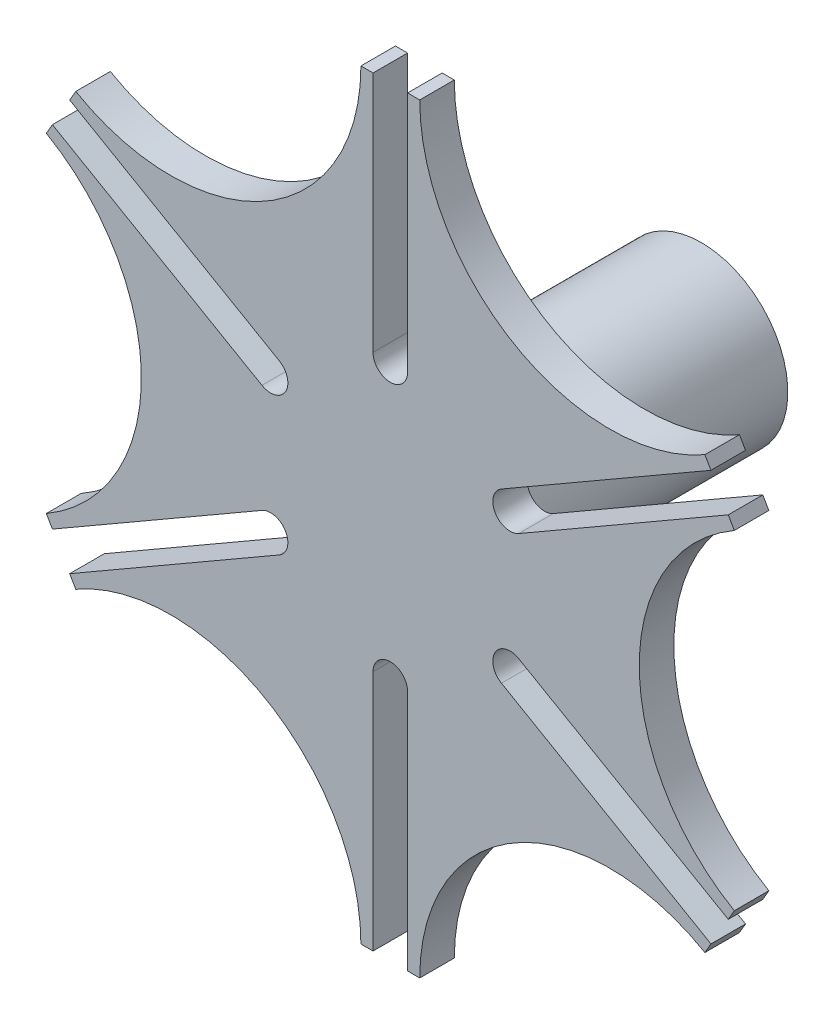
ISO-10303-21;
HEADER;
FILE_DESCRIPTION(('STEP AP214'),'2;1');
FILE_NAME('part.step','',(''),(''),'','','');
FILE_SCHEMA(('AUTOMOTIVE_DESIGN { 1 0 10303 214 1 1 1 1 }'));
ENDSEC;
DATA;
#1=APPLICATION_CONTEXT('core data for automotive mechanical design processes');
#2=APPLICATION_PROTOCOL_DEFINITION('international standard','automotive_design',2000,#1);
#3=PRODUCT_CONTEXT('',#1,'mechanical');
#4=PRODUCT('Part','Part','',(#3));
#5=PRODUCT_RELATED_PRODUCT_CATEGORY('part','',(#4));
#6=PRODUCT_DEFINITION_FORMATION('','',#4);
#7=PRODUCT_DEFINITION_CONTEXT('part definition',#1,'design');
#8=PRODUCT_DEFINITION('design','',#6,#7);
#9=PRODUCT_DEFINITION_SHAPE('','',#8);
#10=(LENGTH_UNIT() NAMED_UNIT(*) SI_UNIT(.MILLI.,.METRE.));
#11=(NAMED_UNIT(*) PLANE_ANGLE_UNIT() SI_UNIT($,.RADIAN.));
#12=(NAMED_UNIT(*) SI_UNIT($,.STERADIAN.) SOLID_ANGLE_UNIT());
#13=UNCERTAINTY_MEASURE_WITH_UNIT(LENGTH_MEASURE(1.E-05),#10,'distance_accuracy_value','');
#14=(GEOMETRIC_REPRESENTATION_CONTEXT(3) GLOBAL_UNCERTAINTY_ASSIGNED_CONTEXT((#13)) GLOBAL_UNIT_ASSIGNED_CONTEXT((#10,
#11,#12)) REPRESENTATION_CONTEXT('',''));
#15=CARTESIAN_POINT('',(0.,0.,0.));
#16=DIRECTION('',(0.,0.,1.));
#17=DIRECTION('',(1.,0.,0.));
#18=AXIS2_PLACEMENT_3D('',#15,#16,#17);
#19=CARTESIAN_POINT('',(161.311665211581,0.,12.7));
#20=DIRECTION('',(-0.866025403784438,-0.500000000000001,0.));
#21=DIRECTION('',(0.500000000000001,-0.866025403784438,0.));
#22=AXIS2_PLACEMENT_3D('',#19,#20,#21);
#23=PLANE('',#22);
#24=DIRECTION('',(-0.500000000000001,0.866025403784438,0.));
#25=VECTOR('',#24,1.);
#26=CARTESIAN_POINT('',(161.311665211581,0.,0.));
#27=LINE('',#26,#25);
#28=CARTESIAN_POINT('',(126.386665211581,60.4918744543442,0.));
#29=VERTEX_POINT('',#28);
#30=CARTESIAN_POINT('',(124.158748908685,64.3507386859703,0.));
#31=VERTEX_POINT('',#30);
#32=EDGE_CURVE('E476',#29,#31,#27,.T.);
#33=ORIENTED_EDGE('',*,*,#32,.T.);
#34=DIRECTION('',(0.,0.,1.));
#35=VECTOR('',#34,1.);
#36=CARTESIAN_POINT('',(124.158748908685,64.3507386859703,-101.6));
#37=LINE('',#36,#35);
#38=CARTESIAN_POINT('',(124.158748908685,64.3507386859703,12.7));
#39=VERTEX_POINT('',#38);
#40=EDGE_CURVE('E285',#31,#39,#37,.T.);
#41=ORIENTED_EDGE('',*,*,#40,.T.);
#42=DIRECTION('',(-0.500000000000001,0.866025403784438,0.));
#43=VECTOR('',#42,1.);
#44=CARTESIAN_POINT('',(161.311665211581,0.,12.7));
#45=LINE('',#44,#43);
#46=CARTESIAN_POINT('',(126.386665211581,60.4918744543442,12.7));
#47=VERTEX_POINT('',#46);
#48=EDGE_CURVE('E499',#47,#39,#45,.T.);
#49=ORIENTED_EDGE('',*,*,#48,.F.);
#50=DIRECTION('',(0.,0.,1.));
#51=VECTOR('',#50,1.);
#52=CARTESIAN_POINT('',(126.386665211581,60.4918744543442,-101.6));
#53=LINE('',#52,#51);
#54=EDGE_CURVE('E329',#29,#47,#53,.T.);
#55=ORIENTED_EDGE('',*,*,#54,.F.);
#56=EDGE_LOOP('',(#33,#41,#49,#55));
#57=FACE_BOUND('',#56,.T.);
#58=ADVANCED_FACE('F28',(#57),#23,.F.);
#59=CARTESIAN_POINT('',(80.6558326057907,-139.7,12.7));
#60=DIRECTION('',(-0.866025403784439,0.5,0.));
#61=DIRECTION('',(-0.5,-0.866025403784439,0.));
#62=AXIS2_PLACEMENT_3D('',#59,#60,#61);
#63=PLANE('',#62);
#64=DIRECTION('',(0.5,0.866025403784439,0.));
#65=VECTOR('',#64,1.);
#66=CARTESIAN_POINT('',(80.6558326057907,-139.7,0.));
#67=LINE('',#66,#65);
#68=CARTESIAN_POINT('',(115.580832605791,-79.2081255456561,0.));
#69=VERTEX_POINT('',#68);
#70=CARTESIAN_POINT('',(117.808748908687,-75.3492613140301,0.));
#71=VERTEX_POINT('',#70);
#72=EDGE_CURVE('E495',#69,#71,#67,.T.);
#73=ORIENTED_EDGE('',*,*,#72,.T.);
#74=DIRECTION('',(0.,0.,1.));
#75=VECTOR('',#74,1.);
#76=CARTESIAN_POINT('',(117.808748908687,-75.3492613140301,-101.6));
#77=LINE('',#76,#75);
#78=CARTESIAN_POINT('',(117.808748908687,-75.3492613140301,12.7));
#79=VERTEX_POINT('',#78);
#80=EDGE_CURVE('E312',#71,#79,#77,.T.);
#81=ORIENTED_EDGE('',*,*,#80,.T.);
#82=DIRECTION('',(0.5,0.866025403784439,0.));
#83=VECTOR('',#82,1.);
#84=CARTESIAN_POINT('',(80.6558326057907,-139.7,12.7));
#85=LINE('',#84,#83);
#86=CARTESIAN_POINT('',(115.580832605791,-79.2081255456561,12.7));
#87=VERTEX_POINT('',#86);
#88=EDGE_CURVE('E11',#87,#79,#85,.T.);
#89=ORIENTED_EDGE('',*,*,#88,.F.);
#90=DIRECTION('',(0.,0.,1.));
#91=VECTOR('',#90,1.);
#92=CARTESIAN_POINT('',(115.580832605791,-79.2081255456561,-101.6));
#93=LINE('',#92,#91);
#94=EDGE_CURVE('E362',#69,#87,#93,.T.);
#95=ORIENTED_EDGE('',*,*,#94,.F.);
#96=EDGE_LOOP('',(#73,#81,#89,#95));
#97=FACE_BOUND('',#96,.T.);
#98=ADVANCED_FACE('F540',(#97),#63,.F.);
#99=CARTESIAN_POINT('',(-80.6558326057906,-139.7,12.7));
#100=DIRECTION('',(0.,1.,0.));
#101=DIRECTION('',(-1.,0.,0.));
#102=AXIS2_PLACEMENT_3D('',#99,#100,#101);
#103=PLANE('',#102);
#104=DIRECTION('',(1.,0.,0.));
#105=VECTOR('',#104,1.);
#106=CARTESIAN_POINT('',(-80.6558326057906,-139.7,0.));
#107=LINE('',#106,#105);
#108=CARTESIAN_POINT('',(-10.80583260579,-139.7,0.));
#109=VERTEX_POINT('',#108);
#110=CARTESIAN_POINT('',(-6.34999999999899,-139.7,0.));
#111=VERTEX_POINT('',#110);
#112=EDGE_CURVE('E491',#109,#111,#107,.T.);
#113=ORIENTED_EDGE('',*,*,#112,.T.);
#114=DIRECTION('',(0.,0.,1.));
#115=VECTOR('',#114,1.);
#116=CARTESIAN_POINT('',(-6.34999999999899,-139.7,-101.6));
#117=LINE('',#116,#115);
#118=CARTESIAN_POINT('',(-6.34999999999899,-139.7,12.7));
#119=VERTEX_POINT('',#118);
#120=EDGE_CURVE('E345',#111,#119,#117,.T.);
#121=ORIENTED_EDGE('',*,*,#120,.T.);
#122=DIRECTION('',(1.,0.,0.));
#123=VECTOR('',#122,1.);
#124=CARTESIAN_POINT('',(-80.6558326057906,-139.7,12.7));
#125=LINE('',#124,#123);
#126=CARTESIAN_POINT('',(-10.80583260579,-139.7,12.7));
#127=VERTEX_POINT('',#126);
#128=EDGE_CURVE('E512',#127,#119,#125,.T.);
#129=ORIENTED_EDGE('',*,*,#128,.F.);
#130=DIRECTION('',(0.,0.,1.));
#131=VECTOR('',#130,1.);
#132=CARTESIAN_POINT('',(-10.80583260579,-139.7,-101.6));
#133=LINE('',#132,#131);
#134=EDGE_CURVE('E395',#109,#127,#133,.T.);
#135=ORIENTED_EDGE('',*,*,#134,.F.);
#136=EDGE_LOOP('',(#113,#121,#129,#135));
#137=FACE_BOUND('',#136,.T.);
#138=ADVANCED_FACE('F665',(#137),#103,.F.);
#139=CARTESIAN_POINT('',(-161.311665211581,0.,12.7));
#140=DIRECTION('',(0.866025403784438,0.5,0.));
#141=DIRECTION('',(-0.5,0.866025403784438,0.));
#142=AXIS2_PLACEMENT_3D('',#139,#140,#141);
#143=PLANE('',#142);
#144=DIRECTION('',(0.5,-0.866025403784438,0.));
#145=VECTOR('',#144,1.);
#146=CARTESIAN_POINT('',(-161.311665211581,0.,0.));
#147=LINE('',#146,#145);
#148=CARTESIAN_POINT('',(-126.386665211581,-60.4918744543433,0.));
#149=VERTEX_POINT('',#148);
#150=CARTESIAN_POINT('',(-124.158748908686,-64.3507386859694,0.));
#151=VERTEX_POINT('',#150);
#152=EDGE_CURVE('E487',#149,#151,#147,.T.);
#153=ORIENTED_EDGE('',*,*,#152,.T.);
#154=DIRECTION('',(0.,0.,1.));
#155=VECTOR('',#154,1.);
#156=CARTESIAN_POINT('',(-124.158748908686,-64.3507386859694,-101.6));
#157=LINE('',#156,#155);
#158=CARTESIAN_POINT('',(-124.158748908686,-64.3507386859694,12.7));
#159=VERTEX_POINT('',#158);
#160=EDGE_CURVE('E378',#151,#159,#157,.T.);
#161=ORIENTED_EDGE('',*,*,#160,.T.);
#162=DIRECTION('',(0.5,-0.866025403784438,0.));
#163=VECTOR('',#162,1.);
#164=CARTESIAN_POINT('',(-161.311665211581,0.,12.7));
#165=LINE('',#164,#163);
#166=CARTESIAN_POINT('',(-126.386665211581,-60.4918744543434,12.7));
#167=VERTEX_POINT('',#166);
#168=EDGE_CURVE('E509',#167,#159,#165,.T.);
#169=ORIENTED_EDGE('',*,*,#168,.F.);
#170=DIRECTION('',(0.,0.,1.));
#171=VECTOR('',#170,1.);
#172=CARTESIAN_POINT('',(-126.386665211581,-60.4918744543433,-101.6));
#173=LINE('',#172,#171);
#174=EDGE_CURVE('E428',#149,#167,#173,.T.);
#175=ORIENTED_EDGE('',*,*,#174,.F.);
#176=EDGE_LOOP('',(#153,#161,#169,#175));
#177=FACE_BOUND('',#176,.T.);
#178=ADVANCED_FACE('F638',(#177),#143,.F.);
#179=CARTESIAN_POINT('',(-80.6558326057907,139.7,12.7));
#180=DIRECTION('',(0.866025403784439,-0.5,0.));
#181=DIRECTION('',(0.5,0.866025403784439,0.));
#182=AXIS2_PLACEMENT_3D('',#179,#180,#181);
#183=PLANE('',#182);
#184=DIRECTION('',(-0.5,-0.866025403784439,0.));
#185=VECTOR('',#184,1.);
#186=CARTESIAN_POINT('',(-80.6558326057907,139.7,0.));
#187=LINE('',#186,#185);
#188=CARTESIAN_POINT('',(-115.580832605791,79.2081255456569,0.));
#189=VERTEX_POINT('',#188);
#190=CARTESIAN_POINT('',(-117.808748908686,75.3492613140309,0.));
#191=VERTEX_POINT('',#190);
#192=EDGE_CURVE('E483',#189,#191,#187,.T.);
#193=ORIENTED_EDGE('',*,*,#192,.T.);
#194=DIRECTION('',(0.,0.,1.));
#195=VECTOR('',#194,1.);
#196=CARTESIAN_POINT('',(-117.808748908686,75.3492613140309,-101.6));
#197=LINE('',#196,#195);
#198=CARTESIAN_POINT('',(-117.808748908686,75.3492613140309,12.7));
#199=VERTEX_POINT('',#198);
#200=EDGE_CURVE('E411',#191,#199,#197,.T.);
#201=ORIENTED_EDGE('',*,*,#200,.T.);
#202=DIRECTION('',(-0.5,-0.866025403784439,0.));
#203=VECTOR('',#202,1.);
#204=CARTESIAN_POINT('',(-80.6558326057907,139.7,12.7));
#205=LINE('',#204,#203);
#206=CARTESIAN_POINT('',(-115.580832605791,79.2081255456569,12.7));
#207=VERTEX_POINT('',#206);
#208=EDGE_CURVE('E505',#207,#199,#205,.T.);
#209=ORIENTED_EDGE('',*,*,#208,.F.);
#210=DIRECTION('',(0.,0.,1.));
#211=VECTOR('',#210,1.);
#212=CARTESIAN_POINT('',(-115.580832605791,79.2081255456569,-101.6));
#213=LINE('',#212,#211);
#214=EDGE_CURVE('E462',#189,#207,#213,.T.);
#215=ORIENTED_EDGE('',*,*,#214,.F.);
#216=EDGE_LOOP('',(#193,#201,#209,#215));
#217=FACE_BOUND('',#216,.T.);
#218=ADVANCED_FACE('F609',(#217),#183,.F.);
#219=CARTESIAN_POINT('',(80.6558326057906,139.7,12.7));
#220=DIRECTION('',(0.,-1.,0.));
#221=DIRECTION('',(0.,0.,-1.));
#222=AXIS2_PLACEMENT_3D('',#219,#220,#221);
#223=PLANE('',#222);
#224=DIRECTION('',(-1.,0.,0.));
#225=VECTOR('',#224,1.);
#226=CARTESIAN_POINT('',(80.6558326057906,139.7,12.7));
#227=LINE('',#226,#225);
#228=CARTESIAN_POINT('',(10.8058326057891,139.7,12.7));
#229=VERTEX_POINT('',#228);
#230=CARTESIAN_POINT('',(6.34999999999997,139.7,12.7));
#231=VERTEX_POINT('',#230);
#232=EDGE_CURVE('E502',#229,#231,#227,.T.);
#233=ORIENTED_EDGE('',*,*,#232,.F.);
#234=DIRECTION('',(0.,0.,1.));
#235=VECTOR('',#234,1.);
#236=CARTESIAN_POINT('',(10.8058326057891,139.7,-101.6));
#237=LINE('',#236,#235);
#238=CARTESIAN_POINT('',(10.8058326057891,139.7,0.));
#239=VERTEX_POINT('',#238);
#240=EDGE_CURVE('E51',#239,#229,#237,.T.);
#241=ORIENTED_EDGE('',*,*,#240,.F.);
#242=DIRECTION('',(-1.,0.,0.));
#243=VECTOR('',#242,1.);
#244=CARTESIAN_POINT('',(80.6558326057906,139.7,0.));
#245=LINE('',#244,#243);
#246=CARTESIAN_POINT('',(6.34999999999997,139.7,0.));
#247=VERTEX_POINT('',#246);
#248=EDGE_CURVE('E480',#239,#247,#245,.T.);
#249=ORIENTED_EDGE('',*,*,#248,.T.);
#250=DIRECTION('',(0.,0.,1.));
#251=VECTOR('',#250,1.);
#252=CARTESIAN_POINT('',(6.34999999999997,139.7,-101.6));
#253=LINE('',#252,#251);
#254=EDGE_CURVE('E445',#247,#231,#253,.T.);
#255=ORIENTED_EDGE('',*,*,#254,.T.);
#256=EDGE_LOOP('',(#233,#241,#249,#255));
#257=FACE_BOUND('',#256,.T.);
#258=ADVANCED_FACE('F581',(#257),#223,.F.);
#259=CARTESIAN_POINT('',(161.311665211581,0.,0.));
#260=DIRECTION('',(0.,0.,-1.));
#261=DIRECTION('',(-1.,0.,0.));
#262=AXIS2_PLACEMENT_3D('',#259,#260,#261);
#263=PLANE('',#262);
#264=DIRECTION('',(-0.866025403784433,-0.500000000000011,0.));
#265=VECTOR('',#264,1.);
#266=CARTESIAN_POINT('',(124.158748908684,64.3507386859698,0.));
#267=LINE('',#266,#265);
#268=CARTESIAN_POINT('',(47.1690905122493,19.9007386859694,0.));
#269=VERTEX_POINT('',#268);
#270=EDGE_CURVE('E293',#31,#269,#267,.T.);
#271=ORIENTED_EDGE('',*,*,#270,.F.);
#272=ORIENTED_EDGE('',*,*,#32,.F.);
#273=CARTESIAN_POINT('',(161.311665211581,1.52655665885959E-12,0.));
#274=DIRECTION('',(0.,0.,-1.));
#275=DIRECTION('',(-1.,0.,0.));
#276=AXIS2_PLACEMENT_3D('',#273,#274,#275);
#277=CIRCLE('',#276,69.85);
#278=CARTESIAN_POINT('',(126.386665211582,-60.4918744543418,0.));
#279=VERTEX_POINT('',#278);
#280=EDGE_CURVE('E333',#279,#29,#277,.T.);
#281=ORIENTED_EDGE('',*,*,#280,.F.);
#282=CARTESIAN_POINT('',(124.158748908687,-64.3507386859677,0.));
#283=VERTEX_POINT('',#282);
#284=EDGE_CURVE('E494',#283,#279,#67,.T.);
#285=ORIENTED_EDGE('',*,*,#284,.F.);
#286=DIRECTION('',(0.866025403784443,-0.499999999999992,0.));
#287=VECTOR('',#286,1.);
#288=CARTESIAN_POINT('',(124.158748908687,-64.350738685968,0.));
#289=LINE('',#288,#287);
#290=CARTESIAN_POINT('',(47.1690905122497,-19.9007386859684,0.));
#291=VERTEX_POINT('',#290);
#292=EDGE_CURVE('E315',#291,#283,#289,.T.);
#293=ORIENTED_EDGE('',*,*,#292,.F.);
#294=CARTESIAN_POINT('',(43.9940905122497,-25.3999999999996,0.));
#295=DIRECTION('',(0.,0.,-1.));
#296=DIRECTION('',(-1.,0.,0.));
#297=AXIS2_PLACEMENT_3D('',#294,#295,#296);
#298=CIRCLE('',#297,6.35000000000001);
#299=CARTESIAN_POINT('',(40.8190905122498,-30.8992613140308,0.));
#300=VERTEX_POINT('',#299);
#301=EDGE_CURVE('E322',#300,#291,#298,.T.);
#302=ORIENTED_EDGE('',*,*,#301,.F.);
#303=DIRECTION('',(-0.866025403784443,0.499999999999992,0.));
#304=VECTOR('',#303,1.);
#305=CARTESIAN_POINT('',(117.808748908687,-75.3492613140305,0.));
#306=LINE('',#305,#304);
#307=EDGE_CURVE('E324',#71,#300,#306,.T.);
#308=ORIENTED_EDGE('',*,*,#307,.F.);
#309=ORIENTED_EDGE('',*,*,#72,.F.);
#310=CARTESIAN_POINT('',(80.6558326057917,-139.699999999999,0.));
#311=DIRECTION('',(0.,0.,-1.));
#312=DIRECTION('',(-1.,0.,0.));
#313=AXIS2_PLACEMENT_3D('',#310,#311,#312);
#314=CIRCLE('',#313,69.85);
#315=CARTESIAN_POINT('',(10.8058326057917,-139.7,0.));
#316=VERTEX_POINT('',#315);
#317=EDGE_CURVE('E366',#316,#69,#314,.T.);
#318=ORIENTED_EDGE('',*,*,#317,.F.);
#319=CARTESIAN_POINT('',(6.350000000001,-139.7,0.));
#320=VERTEX_POINT('',#319);
#321=EDGE_CURVE('E490',#320,#316,#107,.T.);
#322=ORIENTED_EDGE('',*,*,#321,.F.);
#323=DIRECTION('',(0.,-1.,0.));
#324=VECTOR('',#323,1.);
#325=CARTESIAN_POINT('',(6.34999999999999,-1.07550316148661E-12,0.));
#326=LINE('',#325,#324);
#327=CARTESIAN_POINT('',(6.35000000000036,-50.8,0.));
#328=VERTEX_POINT('',#327);
#329=EDGE_CURVE('E348',#328,#320,#326,.T.);
#330=ORIENTED_EDGE('',*,*,#329,.F.);
#331=CARTESIAN_POINT('',(3.54734709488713E-13,-50.8,0.));
#332=DIRECTION('',(0.,0.,-1.));
#333=DIRECTION('',(-1.,0.,0.));
#334=AXIS2_PLACEMENT_3D('',#331,#332,#333);
#335=CIRCLE('',#334,6.35000000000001);
#336=CARTESIAN_POINT('',(-6.34999999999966,-50.8000000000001,0.));
#337=VERTEX_POINT('',#336);
#338=EDGE_CURVE('E355',#337,#328,#335,.T.);
#339=ORIENTED_EDGE('',*,*,#338,.F.);
#340=DIRECTION('',(0.,1.,0.));
#341=VECTOR('',#340,1.);
#342=CARTESIAN_POINT('',(-6.35000000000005,-1.2248106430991E-12,0.));
#343=LINE('',#342,#341);
#344=EDGE_CURVE('E357',#111,#337,#343,.T.);
#345=ORIENTED_EDGE('',*,*,#344,.F.);
#346=ORIENTED_EDGE('',*,*,#112,.F.);
#347=CARTESIAN_POINT('',(-80.65583260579,-139.7,0.));
#348=DIRECTION('',(0.,0.,-1.));
#349=DIRECTION('',(-1.,0.,0.));
#350=AXIS2_PLACEMENT_3D('',#347,#348,#349);
#351=CIRCLE('',#350,69.85);
#352=CARTESIAN_POINT('',(-115.58083260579,-79.2081255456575,0.));
#353=VERTEX_POINT('',#352);
#354=EDGE_CURVE('E399',#353,#109,#351,.T.);
#355=ORIENTED_EDGE('',*,*,#354,.F.);
#356=CARTESIAN_POINT('',(-117.808748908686,-75.3492613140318,0.));
#357=VERTEX_POINT('',#356);
#358=EDGE_CURVE('E486',#357,#353,#147,.T.);
#359=ORIENTED_EDGE('',*,*,#358,.F.);
#360=DIRECTION('',(-0.866025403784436,-0.500000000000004,0.));
#361=VECTOR('',#360,1.);
#362=CARTESIAN_POINT('',(124.158748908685,64.3507386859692,0.));
#363=LINE('',#362,#361);
#364=CARTESIAN_POINT('',(-40.8190905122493,-30.8992613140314,0.));
#365=VERTEX_POINT('',#364);
#366=EDGE_CURVE('E381',#365,#357,#363,.T.);
#367=ORIENTED_EDGE('',*,*,#366,.F.);
#368=CARTESIAN_POINT('',(-43.9940905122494,-25.4000000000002,0.));
#369=DIRECTION('',(0.,0.,-1.));
#370=DIRECTION('',(-1.,0.,0.));
#371=AXIS2_PLACEMENT_3D('',#368,#369,#370);
#372=CIRCLE('',#371,6.35000000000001);
#373=CARTESIAN_POINT('',(-47.1690905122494,-19.900738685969,0.));
#374=VERTEX_POINT('',#373);
#375=EDGE_CURVE('E388',#374,#365,#372,.T.);
#376=ORIENTED_EDGE('',*,*,#375,.F.);
#377=DIRECTION('',(0.866025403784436,0.500000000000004,0.));
#378=VECTOR('',#377,1.);
#379=CARTESIAN_POINT('',(117.808748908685,75.3492613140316,0.));
#380=LINE('',#379,#378);
#381=EDGE_CURVE('E390',#151,#374,#380,.T.);
#382=ORIENTED_EDGE('',*,*,#381,.F.);
#383=ORIENTED_EDGE('',*,*,#152,.F.);
#384=CARTESIAN_POINT('',(-161.311665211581,-4.02455846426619E-13,0.));
#385=DIRECTION('',(0.,0.,-1.));
#386=DIRECTION('',(-1.,0.,0.));
#387=AXIS2_PLACEMENT_3D('',#384,#385,#386);
#388=CIRCLE('',#387,69.85);
#389=CARTESIAN_POINT('',(-126.386665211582,60.4918744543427,0.));
#390=VERTEX_POINT('',#389);
#391=EDGE_CURVE('E432',#390,#149,#388,.T.);
#392=ORIENTED_EDGE('',*,*,#391,.F.);
#393=CARTESIAN_POINT('',(-124.158748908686,64.3507386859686,0.));
#394=VERTEX_POINT('',#393);
#395=EDGE_CURVE('E482',#394,#390,#187,.T.);
#396=ORIENTED_EDGE('',*,*,#395,.F.);
#397=DIRECTION('',(-0.86602540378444,0.499999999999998,0.));
#398=VECTOR('',#397,1.);
#399=CARTESIAN_POINT('',(117.808748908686,-75.349261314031,0.));
#400=LINE('',#399,#398);
#401=CARTESIAN_POINT('',(-47.1690905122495,19.9007386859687,0.));
#402=VERTEX_POINT('',#401);
#403=EDGE_CURVE('E414',#402,#394,#400,.T.);
#404=ORIENTED_EDGE('',*,*,#403,.F.);
#405=CARTESIAN_POINT('',(-43.9940905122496,25.3999999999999,0.));
#406=DIRECTION('',(0.,0.,-1.));
#407=DIRECTION('',(-1.,0.,0.));
#408=AXIS2_PLACEMENT_3D('',#405,#406,#407);
#409=CIRCLE('',#408,6.35000000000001);
#410=CARTESIAN_POINT('',(-40.8190905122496,30.8992613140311,0.));
#411=VERTEX_POINT('',#410);
#412=EDGE_CURVE('E421',#411,#402,#409,.T.);
#413=ORIENTED_EDGE('',*,*,#412,.F.);
#414=DIRECTION('',(0.86602540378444,-0.499999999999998,0.));
#415=VECTOR('',#414,1.);
#416=CARTESIAN_POINT('',(124.158748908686,-64.3507386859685,0.));
#417=LINE('',#416,#415);
#418=EDGE_CURVE('E423',#191,#411,#417,.T.);
#419=ORIENTED_EDGE('',*,*,#418,.F.);
#420=ORIENTED_EDGE('',*,*,#192,.F.);
#421=CARTESIAN_POINT('',(-80.6558326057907,139.7,0.));
#422=DIRECTION('',(0.,0.,-1.));
#423=DIRECTION('',(-1.,0.,0.));
#424=AXIS2_PLACEMENT_3D('',#421,#422,#423);
#425=CIRCLE('',#424,69.85);
#426=CARTESIAN_POINT('',(-10.8058326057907,139.7,0.));
#427=VERTEX_POINT('',#426);
#428=EDGE_CURVE('E466',#427,#189,#425,.T.);
#429=ORIENTED_EDGE('',*,*,#428,.F.);
#430=CARTESIAN_POINT('',(-6.35000000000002,139.7,0.));
#431=VERTEX_POINT('',#430);
#432=EDGE_CURVE('E479',#431,#427,#245,.T.);
#433=ORIENTED_EDGE('',*,*,#432,.F.);
#434=DIRECTION('',(0.,1.,0.));
#435=VECTOR('',#434,1.);
#436=CARTESIAN_POINT('',(-6.34999999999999,0.,0.));
#437=LINE('',#436,#435);
#438=CARTESIAN_POINT('',(-6.35000000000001,50.8,0.));
#439=VERTEX_POINT('',#438);
#440=EDGE_CURVE('E448',#439,#431,#437,.T.);
#441=ORIENTED_EDGE('',*,*,#440,.F.);
#442=CARTESIAN_POINT('',(0.,50.8,0.));
#443=DIRECTION('',(0.,0.,-1.));
#444=DIRECTION('',(-1.,0.,0.));
#445=AXIS2_PLACEMENT_3D('',#442,#443,#444);
#446=CIRCLE('',#445,6.35000000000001);
#447=CARTESIAN_POINT('',(6.35000000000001,50.8,0.));
#448=VERTEX_POINT('',#447);
#449=EDGE_CURVE('E455',#448,#439,#446,.T.);
#450=ORIENTED_EDGE('',*,*,#449,.F.);
#451=DIRECTION('',(0.,-1.,0.));
#452=VECTOR('',#451,1.);
#453=CARTESIAN_POINT('',(6.35000000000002,0.,0.));
#454=LINE('',#453,#452);
#455=EDGE_CURVE('E457',#247,#448,#454,.T.);
#456=ORIENTED_EDGE('',*,*,#455,.F.);
#457=ORIENTED_EDGE('',*,*,#248,.F.);
#458=CARTESIAN_POINT('',(80.6558326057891,139.700000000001,0.));
#459=DIRECTION('',(0.,0.,-1.));
#460=DIRECTION('',(-1.,0.,0.));
#461=AXIS2_PLACEMENT_3D('',#458,#459,#460);
#462=CIRCLE('',#461,69.85);
#463=CARTESIAN_POINT('',(115.58083260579,79.2081255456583,0.));
#464=VERTEX_POINT('',#463);
#465=EDGE_CURVE('E300',#464,#239,#462,.T.);
#466=ORIENTED_EDGE('',*,*,#465,.F.);
#467=CARTESIAN_POINT('',(117.808748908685,75.3492613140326,0.));
#468=VERTEX_POINT('',#467);
#469=EDGE_CURVE('E475',#468,#464,#27,.T.);
#470=ORIENTED_EDGE('',*,*,#469,.F.);
#471=DIRECTION('',(0.866025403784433,0.50000000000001,0.));
#472=VECTOR('',#471,1.);
#473=CARTESIAN_POINT('',(117.808748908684,75.3492613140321,0.));
#474=LINE('',#473,#472);
#475=CARTESIAN_POINT('',(40.8190905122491,30.8992613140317,0.));
#476=VERTEX_POINT('',#475);
#477=EDGE_CURVE('E288',#476,#468,#474,.T.);
#478=ORIENTED_EDGE('',*,*,#477,.F.);
#479=CARTESIAN_POINT('',(43.9940905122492,25.4000000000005,0.));
#480=DIRECTION('',(0.,0.,-1.));
#481=DIRECTION('',(-1.,0.,0.));
#482=AXIS2_PLACEMENT_3D('',#479,#480,#481);
#483=CIRCLE('',#482,6.35000000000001);
#484=EDGE_CURVE('E270',#269,#476,#483,.T.);
#485=ORIENTED_EDGE('',*,*,#484,.F.);
#486=EDGE_LOOP('',(#271,#272,#281,#285,#293,#302,#308,#309,#318,#322,#330,#339,#345,#346,#355,
#359,#367,#376,#382,#383,#392,#396,#404,#413,#419,#420,#429,#433,#441,#450,#456,#457,#466,#470,
#478,#485));
#487=FACE_BOUND('',#486,.T.);
#488=CARTESIAN_POINT('',(0.,0.,0.));
#489=DIRECTION('',(0.,0.,-1.));
#490=DIRECTION('',(-1.,0.,0.));
#491=AXIS2_PLACEMENT_3D('',#488,#489,#490);
#492=CIRCLE('',#491,31.75);
#493=CARTESIAN_POINT('',(-31.75,0.,0.));
#494=VERTEX_POINT('',#493);
#495=EDGE_CURVE('E469',#494,#494,#492,.T.);
#496=ORIENTED_EDGE('',*,*,#495,.F.);
#497=EDGE_LOOP('',(#496));
#498=FACE_BOUND('',#497,.T.);
#499=ADVANCED_FACE('F534',(#487,#498),#263,.T.);
#500=CARTESIAN_POINT('',(117.808748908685,75.3492613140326,12.7));
#501=VERTEX_POINT('',#500);
#502=CARTESIAN_POINT('',(115.58083260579,79.2081255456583,12.7));
#503=VERTEX_POINT('',#502);
#504=EDGE_CURVE('E498',#501,#503,#45,.T.);
#505=ORIENTED_EDGE('',*,*,#504,.F.);
#506=DIRECTION('',(0.,0.,1.));
#507=VECTOR('',#506,1.);
#508=CARTESIAN_POINT('',(117.808748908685,75.3492613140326,-101.6));
#509=LINE('',#508,#507);
#510=EDGE_CURVE('E43',#468,#501,#509,.T.);
#511=ORIENTED_EDGE('',*,*,#510,.F.);
#512=ORIENTED_EDGE('',*,*,#469,.T.);
#513=DIRECTION('',(0.,0.,1.));
#514=VECTOR('',#513,1.);
#515=CARTESIAN_POINT('',(115.58083260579,79.2081255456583,-101.6));
#516=LINE('',#515,#514);
#517=EDGE_CURVE('E297',#464,#503,#516,.T.);
#518=ORIENTED_EDGE('',*,*,#517,.T.);
#519=EDGE_LOOP('',(#505,#511,#512,#518));
#520=FACE_BOUND('',#519,.T.);
#521=ADVANCED_FACE('F30',(#520),#23,.F.);
#522=CARTESIAN_POINT('',(-6.34999999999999,139.7,12.7));
#523=VERTEX_POINT('',#522);
#524=CARTESIAN_POINT('',(-10.8058326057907,139.7,12.7));
#525=VERTEX_POINT('',#524);
#526=EDGE_CURVE('E501',#523,#525,#227,.T.);
#527=ORIENTED_EDGE('',*,*,#526,.F.);
#528=DIRECTION('',(0.,0.,1.));
#529=VECTOR('',#528,1.);
#530=CARTESIAN_POINT('',(-6.35000000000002,139.7,-101.6));
#531=LINE('',#530,#529);
#532=EDGE_CURVE('E444',#431,#523,#531,.T.);
#533=ORIENTED_EDGE('',*,*,#532,.F.);
#534=ORIENTED_EDGE('',*,*,#432,.T.);
#535=DIRECTION('',(0.,0.,1.));
#536=VECTOR('',#535,1.);
#537=CARTESIAN_POINT('',(-10.8058326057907,139.7,-101.6));
#538=LINE('',#537,#536);
#539=EDGE_CURVE('E463',#427,#525,#538,.T.);
#540=ORIENTED_EDGE('',*,*,#539,.T.);
#541=EDGE_LOOP('',(#527,#533,#534,#540));
#542=FACE_BOUND('',#541,.T.);
#543=ADVANCED_FACE('F598',(#542),#223,.F.);
#544=CARTESIAN_POINT('',(-124.158748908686,64.3507386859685,12.7));
#545=VERTEX_POINT('',#544);
#546=CARTESIAN_POINT('',(-126.386665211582,60.4918744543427,12.7));
#547=VERTEX_POINT('',#546);
#548=EDGE_CURVE('E504',#545,#547,#205,.T.);
#549=ORIENTED_EDGE('',*,*,#548,.F.);
#550=DIRECTION('',(0.,0.,1.));
#551=VECTOR('',#550,1.);
#552=CARTESIAN_POINT('',(-124.158748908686,64.3507386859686,-101.6));
#553=LINE('',#552,#551);
#554=EDGE_CURVE('E410',#394,#545,#553,.T.);
#555=ORIENTED_EDGE('',*,*,#554,.F.);
#556=ORIENTED_EDGE('',*,*,#395,.T.);
#557=DIRECTION('',(0.,0.,1.));
#558=VECTOR('',#557,1.);
#559=CARTESIAN_POINT('',(-126.386665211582,60.4918744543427,-101.6));
#560=LINE('',#559,#558);
#561=EDGE_CURVE('E429',#390,#547,#560,.T.);
#562=ORIENTED_EDGE('',*,*,#561,.T.);
#563=EDGE_LOOP('',(#549,#555,#556,#562));
#564=FACE_BOUND('',#563,.T.);
#565=ADVANCED_FACE('F627',(#564),#183,.F.);
#566=CARTESIAN_POINT('',(-117.808748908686,-75.3492613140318,12.7));
#567=VERTEX_POINT('',#566);
#568=CARTESIAN_POINT('',(-115.58083260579,-79.2081255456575,12.7));
#569=VERTEX_POINT('',#568);
#570=EDGE_CURVE('E508',#567,#569,#165,.T.);
#571=ORIENTED_EDGE('',*,*,#570,.F.);
#572=DIRECTION('',(0.,0.,1.));
#573=VECTOR('',#572,1.);
#574=CARTESIAN_POINT('',(-117.808748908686,-75.3492613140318,-101.6));
#575=LINE('',#574,#573);
#576=EDGE_CURVE('E377',#357,#567,#575,.T.);
#577=ORIENTED_EDGE('',*,*,#576,.F.);
#578=ORIENTED_EDGE('',*,*,#358,.T.);
#579=DIRECTION('',(0.,0.,1.));
#580=VECTOR('',#579,1.);
#581=CARTESIAN_POINT('',(-115.58083260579,-79.2081255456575,-101.6));
#582=LINE('',#581,#580);
#583=EDGE_CURVE('E396',#353,#569,#582,.T.);
#584=ORIENTED_EDGE('',*,*,#583,.T.);
#585=EDGE_LOOP('',(#571,#577,#578,#584));
#586=FACE_BOUND('',#585,.T.);
#587=ADVANCED_FACE('F655',(#586),#143,.F.);
#588=CARTESIAN_POINT('',(6.35000000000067,-139.7,12.7));
#589=VERTEX_POINT('',#588);
#590=CARTESIAN_POINT('',(10.8058326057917,-139.7,12.7));
#591=VERTEX_POINT('',#590);
#592=EDGE_CURVE('E511',#589,#591,#125,.T.);
#593=ORIENTED_EDGE('',*,*,#592,.F.);
#594=DIRECTION('',(0.,0.,1.));
#595=VECTOR('',#594,1.);
#596=CARTESIAN_POINT('',(6.350000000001,-139.7,-101.6));
#597=LINE('',#596,#595);
#598=EDGE_CURVE('E344',#320,#589,#597,.T.);
#599=ORIENTED_EDGE('',*,*,#598,.F.);
#600=ORIENTED_EDGE('',*,*,#321,.T.);
#601=DIRECTION('',(0.,0.,1.));
#602=VECTOR('',#601,1.);
#603=CARTESIAN_POINT('',(10.8058326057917,-139.7,-101.6));
#604=LINE('',#603,#602);
#605=EDGE_CURVE('E363',#316,#591,#604,.T.);
#606=ORIENTED_EDGE('',*,*,#605,.T.);
#607=EDGE_LOOP('',(#593,#599,#600,#606));
#608=FACE_BOUND('',#607,.T.);
#609=ADVANCED_FACE('F529',(#608),#103,.F.);
#610=CARTESIAN_POINT('',(124.158748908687,-64.3507386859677,12.7));
#611=VERTEX_POINT('',#610);
#612=CARTESIAN_POINT('',(126.386665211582,-60.4918744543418,12.7));
#613=VERTEX_POINT('',#612);
#614=EDGE_CURVE('E36',#611,#613,#85,.T.);
#615=ORIENTED_EDGE('',*,*,#614,.F.);
#616=DIRECTION('',(0.,0.,1.));
#617=VECTOR('',#616,1.);
#618=CARTESIAN_POINT('',(124.158748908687,-64.3507386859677,-101.6));
#619=LINE('',#618,#617);
#620=EDGE_CURVE('E311',#283,#611,#619,.T.);
#621=ORIENTED_EDGE('',*,*,#620,.F.);
#622=ORIENTED_EDGE('',*,*,#284,.T.);
#623=DIRECTION('',(0.,0.,1.));
#624=VECTOR('',#623,1.);
#625=CARTESIAN_POINT('',(126.386665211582,-60.4918744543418,-101.6));
#626=LINE('',#625,#624);
#627=EDGE_CURVE('E330',#279,#613,#626,.T.);
#628=ORIENTED_EDGE('',*,*,#627,.T.);
#629=EDGE_LOOP('',(#615,#621,#622,#628));
#630=FACE_BOUND('',#629,.T.);
#631=ADVANCED_FACE('F558',(#630),#63,.F.);
#632=CARTESIAN_POINT('',(161.311665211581,0.,12.7));
#633=DIRECTION('',(0.,0.,-1.));
#634=DIRECTION('',(-1.,0.,0.));
#635=AXIS2_PLACEMENT_3D('',#632,#633,#634);
#636=PLANE('',#635);
#637=ORIENTED_EDGE('',*,*,#48,.T.);
#638=DIRECTION('',(0.866025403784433,0.500000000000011,0.));
#639=VECTOR('',#638,1.);
#640=CARTESIAN_POINT('',(124.158748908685,64.3507386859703,12.7));
#641=LINE('',#640,#639);
#642=CARTESIAN_POINT('',(47.1690905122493,19.9007386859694,12.7));
#643=VERTEX_POINT('',#642);
#644=EDGE_CURVE('E281',#643,#39,#641,.T.);
#645=ORIENTED_EDGE('',*,*,#644,.F.);
#646=CARTESIAN_POINT('',(43.9940905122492,25.4000000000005,12.7));
#647=DIRECTION('',(0.,0.,1.));
#648=DIRECTION('',(0.50000000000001,-0.866025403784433,0.));
#649=AXIS2_PLACEMENT_3D('',#646,#647,#648);
#650=CIRCLE('',#649,6.35000000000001);
#651=CARTESIAN_POINT('',(40.8190905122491,30.8992613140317,12.7));
#652=VERTEX_POINT('',#651);
#653=EDGE_CURVE('E267',#652,#643,#650,.T.);
#654=ORIENTED_EDGE('',*,*,#653,.F.);
#655=DIRECTION('',(-0.866025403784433,-0.50000000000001,0.));
#656=VECTOR('',#655,1.);
#657=CARTESIAN_POINT('',(117.808748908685,75.3492613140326,12.7));
#658=LINE('',#657,#656);
#659=EDGE_CURVE('E274',#501,#652,#658,.T.);
#660=ORIENTED_EDGE('',*,*,#659,.F.);
#661=ORIENTED_EDGE('',*,*,#504,.T.);
#662=CARTESIAN_POINT('',(80.6558326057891,139.700000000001,12.7));
#663=DIRECTION('',(0.,0.,1.));
#664=DIRECTION('',(0.50000000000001,-0.866025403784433,0.));
#665=AXIS2_PLACEMENT_3D('',#662,#663,#664);
#666=CIRCLE('',#665,69.85);
#667=EDGE_CURVE('E295',#229,#503,#666,.T.);
#668=ORIENTED_EDGE('',*,*,#667,.F.);
#669=ORIENTED_EDGE('',*,*,#232,.T.);
#670=DIRECTION('',(0.,1.,0.));
#671=VECTOR('',#670,1.);
#672=CARTESIAN_POINT('',(6.34999999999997,139.7,12.7));
#673=LINE('',#672,#671);
#674=CARTESIAN_POINT('',(6.35000000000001,50.8,12.7));
#675=VERTEX_POINT('',#674);
#676=EDGE_CURVE('E441',#675,#231,#673,.T.);
#677=ORIENTED_EDGE('',*,*,#676,.F.);
#678=CARTESIAN_POINT('',(0.,50.8,12.7));
#679=DIRECTION('',(0.,0.,1.));
#680=DIRECTION('',(1.,0.,0.));
#681=AXIS2_PLACEMENT_3D('',#678,#679,#680);
#682=CIRCLE('',#681,6.35000000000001);
#683=CARTESIAN_POINT('',(-6.35000000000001,50.8,12.7));
#684=VERTEX_POINT('',#683);
#685=EDGE_CURVE('E438',#684,#675,#682,.T.);
#686=ORIENTED_EDGE('',*,*,#685,.F.);
#687=DIRECTION('',(0.,-1.,0.));
#688=VECTOR('',#687,1.);
#689=CARTESIAN_POINT('',(-6.35000000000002,139.7,12.7));
#690=LINE('',#689,#688);
#691=EDGE_CURVE('E435',#523,#684,#690,.T.);
#692=ORIENTED_EDGE('',*,*,#691,.F.);
#693=ORIENTED_EDGE('',*,*,#526,.T.);
#694=CARTESIAN_POINT('',(-80.6558326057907,139.7,12.7));
#695=DIRECTION('',(0.,0.,1.));
#696=DIRECTION('',(1.,0.,0.));
#697=AXIS2_PLACEMENT_3D('',#694,#695,#696);
#698=CIRCLE('',#697,69.85);
#699=EDGE_CURVE('E459',#207,#525,#698,.T.);
#700=ORIENTED_EDGE('',*,*,#699,.F.);
#701=ORIENTED_EDGE('',*,*,#208,.T.);
#702=DIRECTION('',(-0.86602540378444,0.499999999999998,0.));
#703=VECTOR('',#702,1.);
#704=CARTESIAN_POINT('',(-117.808748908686,75.3492613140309,12.7));
#705=LINE('',#704,#703);
#706=CARTESIAN_POINT('',(-40.8190905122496,30.8992613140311,12.7));
#707=VERTEX_POINT('',#706);
#708=EDGE_CURVE('E408',#707,#199,#705,.T.);
#709=ORIENTED_EDGE('',*,*,#708,.F.);
#710=CARTESIAN_POINT('',(-43.9940905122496,25.3999999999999,12.7));
#711=DIRECTION('',(0.,0.,1.));
#712=DIRECTION('',(0.499999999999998,0.86602540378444,0.));
#713=AXIS2_PLACEMENT_3D('',#710,#711,#712);
#714=CIRCLE('',#713,6.35000000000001);
#715=CARTESIAN_POINT('',(-47.1690905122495,19.9007386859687,12.7));
#716=VERTEX_POINT('',#715);
#717=EDGE_CURVE('E405',#716,#707,#714,.T.);
#718=ORIENTED_EDGE('',*,*,#717,.F.);
#719=DIRECTION('',(0.86602540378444,-0.499999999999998,0.));
#720=VECTOR('',#719,1.);
#721=CARTESIAN_POINT('',(-124.158748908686,64.3507386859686,12.7));
#722=LINE('',#721,#720);
#723=EDGE_CURVE('E402',#545,#716,#722,.T.);
#724=ORIENTED_EDGE('',*,*,#723,.F.);
#725=ORIENTED_EDGE('',*,*,#548,.T.);
#726=CARTESIAN_POINT('',(-161.311665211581,-4.02455846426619E-13,12.7));
#727=DIRECTION('',(0.,0.,1.));
#728=DIRECTION('',(0.499999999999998,0.86602540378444,0.));
#729=AXIS2_PLACEMENT_3D('',#726,#727,#728);
#730=CIRCLE('',#729,69.85);
#731=EDGE_CURVE('E425',#167,#547,#730,.T.);
#732=ORIENTED_EDGE('',*,*,#731,.F.);
#733=ORIENTED_EDGE('',*,*,#168,.T.);
#734=DIRECTION('',(-0.866025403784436,-0.500000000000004,0.));
#735=VECTOR('',#734,1.);
#736=CARTESIAN_POINT('',(-124.158748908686,-64.3507386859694,12.7));
#737=LINE('',#736,#735);
#738=CARTESIAN_POINT('',(-47.1690905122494,-19.900738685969,12.7));
#739=VERTEX_POINT('',#738);
#740=EDGE_CURVE('E375',#739,#159,#737,.T.);
#741=ORIENTED_EDGE('',*,*,#740,.F.);
#742=CARTESIAN_POINT('',(-43.9940905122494,-25.4000000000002,12.7));
#743=DIRECTION('',(0.,0.,1.));
#744=DIRECTION('',(-0.500000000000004,0.866025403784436,0.));
#745=AXIS2_PLACEMENT_3D('',#742,#743,#744);
#746=CIRCLE('',#745,6.35000000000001);
#747=CARTESIAN_POINT('',(-40.8190905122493,-30.8992613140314,12.7));
#748=VERTEX_POINT('',#747);
#749=EDGE_CURVE('E372',#748,#739,#746,.T.);
#750=ORIENTED_EDGE('',*,*,#749,.F.);
#751=DIRECTION('',(0.866025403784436,0.500000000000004,0.));
#752=VECTOR('',#751,1.);
#753=CARTESIAN_POINT('',(-117.808748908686,-75.3492613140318,12.7));
#754=LINE('',#753,#752);
#755=EDGE_CURVE('E369',#567,#748,#754,.T.);
#756=ORIENTED_EDGE('',*,*,#755,.F.);
#757=ORIENTED_EDGE('',*,*,#570,.T.);
#758=CARTESIAN_POINT('',(-80.65583260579,-139.7,12.7));
#759=DIRECTION('',(0.,0.,1.));
#760=DIRECTION('',(-0.500000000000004,0.866025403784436,0.));
#761=AXIS2_PLACEMENT_3D('',#758,#759,#760);
#762=CIRCLE('',#761,69.85);
#763=EDGE_CURVE('E392',#127,#569,#762,.T.);
#764=ORIENTED_EDGE('',*,*,#763,.F.);
#765=ORIENTED_EDGE('',*,*,#128,.T.);
#766=DIRECTION('',(0.,-1.,0.));
#767=VECTOR('',#766,1.);
#768=CARTESIAN_POINT('',(-6.34999999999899,-139.7,12.7));
#769=LINE('',#768,#767);
#770=CARTESIAN_POINT('',(-6.34999999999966,-50.8000000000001,12.7));
#771=VERTEX_POINT('',#770);
#772=EDGE_CURVE('E342',#771,#119,#769,.T.);
#773=ORIENTED_EDGE('',*,*,#772,.F.);
#774=CARTESIAN_POINT('',(3.54734709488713E-13,-50.8,12.7));
#775=DIRECTION('',(0.,0.,1.));
#776=DIRECTION('',(-1.,0.,0.));
#777=AXIS2_PLACEMENT_3D('',#774,#775,#776);
#778=CIRCLE('',#777,6.35000000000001);
#779=CARTESIAN_POINT('',(6.35000000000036,-50.8,12.7));
#780=VERTEX_POINT('',#779);
#781=EDGE_CURVE('E339',#780,#771,#778,.T.);
#782=ORIENTED_EDGE('',*,*,#781,.F.);
#783=DIRECTION('',(0.,1.,0.));
#784=VECTOR('',#783,1.);
#785=CARTESIAN_POINT('',(6.350000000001,-139.7,12.7));
#786=LINE('',#785,#784);
#787=EDGE_CURVE('E336',#589,#780,#786,.T.);
#788=ORIENTED_EDGE('',*,*,#787,.F.);
#789=ORIENTED_EDGE('',*,*,#592,.T.);
#790=CARTESIAN_POINT('',(80.6558326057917,-139.699999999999,12.7));
#791=DIRECTION('',(0.,0.,1.));
#792=DIRECTION('',(-1.,0.,0.));
#793=AXIS2_PLACEMENT_3D('',#790,#791,#792);
#794=CIRCLE('',#793,69.85);
#795=EDGE_CURVE('E359',#87,#591,#794,.T.);
#796=ORIENTED_EDGE('',*,*,#795,.F.);
#797=ORIENTED_EDGE('',*,*,#88,.T.);
#798=DIRECTION('',(0.866025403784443,-0.499999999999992,0.));
#799=VECTOR('',#798,1.);
#800=CARTESIAN_POINT('',(117.808748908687,-75.3492613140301,12.7));
#801=LINE('',#800,#799);
#802=CARTESIAN_POINT('',(40.8190905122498,-30.8992613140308,12.7));
#803=VERTEX_POINT('',#802);
#804=EDGE_CURVE('E309',#803,#79,#801,.T.);
#805=ORIENTED_EDGE('',*,*,#804,.F.);
#806=CARTESIAN_POINT('',(43.9940905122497,-25.3999999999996,12.7));
#807=DIRECTION('',(0.,0.,1.));
#808=DIRECTION('',(-0.499999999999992,-0.866025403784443,0.));
#809=AXIS2_PLACEMENT_3D('',#806,#807,#808);
#810=CIRCLE('',#809,6.35000000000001);
#811=CARTESIAN_POINT('',(47.1690905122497,-19.9007386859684,12.7));
#812=VERTEX_POINT('',#811);
#813=EDGE_CURVE('E306',#812,#803,#810,.T.);
#814=ORIENTED_EDGE('',*,*,#813,.F.);
#815=DIRECTION('',(-0.866025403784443,0.499999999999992,0.));
#816=VECTOR('',#815,1.);
#817=CARTESIAN_POINT('',(124.158748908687,-64.3507386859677,12.7));
#818=LINE('',#817,#816);
#819=EDGE_CURVE('E303',#611,#812,#818,.T.);
#820=ORIENTED_EDGE('',*,*,#819,.F.);
#821=ORIENTED_EDGE('',*,*,#614,.T.);
#822=CARTESIAN_POINT('',(161.311665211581,1.52655665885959E-12,12.7));
#823=DIRECTION('',(0.,0.,1.));
#824=DIRECTION('',(-0.499999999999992,-0.866025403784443,0.));
#825=AXIS2_PLACEMENT_3D('',#822,#823,#824);
#826=CIRCLE('',#825,69.85);
#827=EDGE_CURVE('E326',#47,#613,#826,.T.);
#828=ORIENTED_EDGE('',*,*,#827,.F.);
#829=EDGE_LOOP('',(#637,#645,#654,#660,#661,#668,#669,#677,#686,#692,#693,#700,#701,#709,#718,
#724,#725,#732,#733,#741,#750,#756,#757,#764,#765,#773,#782,#788,#789,#796,#797,#805,#814,#820,
#821,#828));
#830=FACE_BOUND('',#829,.T.);
#831=ADVANCED_FACE('F280',(#830),#636,.F.);
#832=CARTESIAN_POINT('',(0.,0.,-101.6));
#833=DIRECTION('',(0.,0.,1.));
#834=DIRECTION('',(1.,0.,0.));
#835=AXIS2_PLACEMENT_3D('',#832,#833,#834);
#836=CYLINDRICAL_SURFACE('',#835,31.75);
#837=CARTESIAN_POINT('',(0.,0.,-101.6));
#838=DIRECTION('',(0.,0.,-1.));
#839=DIRECTION('',(-1.,0.,0.));
#840=AXIS2_PLACEMENT_3D('',#837,#838,#839);
#841=CIRCLE('',#840,31.75);
#842=CARTESIAN_POINT('',(-31.75,0.,-101.6));
#843=VERTEX_POINT('',#842);
#844=EDGE_CURVE('E472',#843,#843,#841,.T.);
#845=ORIENTED_EDGE('',*,*,#844,.F.);
#846=EDGE_LOOP('',(#845));
#847=FACE_BOUND('',#846,.T.);
#848=ORIENTED_EDGE('',*,*,#495,.T.);
#849=EDGE_LOOP('',(#848));
#850=FACE_BOUND('',#849,.T.);
#851=ADVANCED_FACE('F701',(#847,#850),#836,.T.);
#852=CARTESIAN_POINT('',(0.,0.,-101.6));
#853=DIRECTION('',(0.,0.,-1.));
#854=DIRECTION('',(-1.,0.,0.));
#855=AXIS2_PLACEMENT_3D('',#852,#853,#854);
#856=PLANE('',#855);
#857=ORIENTED_EDGE('',*,*,#844,.T.);
#858=EDGE_LOOP('',(#857));
#859=FACE_BOUND('',#858,.T.);
#860=ADVANCED_FACE('F847',(#859),#856,.T.);
#861=CARTESIAN_POINT('',(-80.6558326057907,139.7,-101.6));
#862=DIRECTION('',(0.,0.,1.));
#863=DIRECTION('',(1.,0.,0.));
#864=AXIS2_PLACEMENT_3D('',#861,#862,#863);
#865=CYLINDRICAL_SURFACE('',#864,69.85);
#866=ORIENTED_EDGE('',*,*,#428,.T.);
#867=ORIENTED_EDGE('',*,*,#214,.T.);
#868=ORIENTED_EDGE('',*,*,#699,.T.);
#869=ORIENTED_EDGE('',*,*,#539,.F.);
#870=EDGE_LOOP('',(#866,#867,#868,#869));
#871=FACE_BOUND('',#870,.T.);
#872=ADVANCED_FACE('F605',(#871),#865,.F.);
#873=CARTESIAN_POINT('',(6.34999999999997,139.7,-101.6));
#874=DIRECTION('',(1.,0.,0.));
#875=DIRECTION('',(0.,1.,0.));
#876=AXIS2_PLACEMENT_3D('',#873,#874,#875);
#877=PLANE('',#876);
#878=ORIENTED_EDGE('',*,*,#455,.T.);
#879=DIRECTION('',(0.,0.,1.));
#880=VECTOR('',#879,1.);
#881=CARTESIAN_POINT('',(6.35000000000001,50.8,-101.6));
#882=LINE('',#881,#880);
#883=EDGE_CURVE('E449',#448,#675,#882,.T.);
#884=ORIENTED_EDGE('',*,*,#883,.T.);
#885=ORIENTED_EDGE('',*,*,#676,.T.);
#886=ORIENTED_EDGE('',*,*,#254,.F.);
#887=EDGE_LOOP('',(#878,#884,#885,#886));
#888=FACE_BOUND('',#887,.T.);
#889=ADVANCED_FACE('F583',(#888),#877,.F.);
#890=CARTESIAN_POINT('',(0.,50.8,-101.6));
#891=DIRECTION('',(0.,0.,1.));
#892=DIRECTION('',(1.,0.,0.));
#893=AXIS2_PLACEMENT_3D('',#890,#891,#892);
#894=CYLINDRICAL_SURFACE('',#893,6.35000000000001);
#895=ORIENTED_EDGE('',*,*,#449,.T.);
#896=DIRECTION('',(0.,0.,1.));
#897=VECTOR('',#896,1.);
#898=CARTESIAN_POINT('',(-6.35000000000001,50.8,-101.6));
#899=LINE('',#898,#897);
#900=EDGE_CURVE('E451',#439,#684,#899,.T.);
#901=ORIENTED_EDGE('',*,*,#900,.T.);
#902=ORIENTED_EDGE('',*,*,#685,.T.);
#903=ORIENTED_EDGE('',*,*,#883,.F.);
#904=EDGE_LOOP('',(#895,#901,#902,#903));
#905=FACE_BOUND('',#904,.T.);
#906=ADVANCED_FACE('F590',(#905),#894,.F.);
#907=CARTESIAN_POINT('',(-6.35000000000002,139.7,-101.6));
#908=DIRECTION('',(-1.,0.,0.));
#909=DIRECTION('',(0.,-1.,0.));
#910=AXIS2_PLACEMENT_3D('',#907,#908,#909);
#911=PLANE('',#910);
#912=ORIENTED_EDGE('',*,*,#440,.T.);
#913=ORIENTED_EDGE('',*,*,#532,.T.);
#914=ORIENTED_EDGE('',*,*,#691,.T.);
#915=ORIENTED_EDGE('',*,*,#900,.F.);
#916=EDGE_LOOP('',(#912,#913,#914,#915));
#917=FACE_BOUND('',#916,.T.);
#918=ADVANCED_FACE('F594',(#917),#911,.F.);
#919=CARTESIAN_POINT('',(-161.311665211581,-4.02455846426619E-13,-101.6));
#920=DIRECTION('',(0.,0.,1.));
#921=DIRECTION('',(1.,0.,0.));
#922=AXIS2_PLACEMENT_3D('',#919,#920,#921);
#923=CYLINDRICAL_SURFACE('',#922,69.85);
#924=ORIENTED_EDGE('',*,*,#391,.T.);
#925=ORIENTED_EDGE('',*,*,#174,.T.);
#926=ORIENTED_EDGE('',*,*,#731,.T.);
#927=ORIENTED_EDGE('',*,*,#561,.F.);
#928=EDGE_LOOP('',(#924,#925,#926,#927));
#929=FACE_BOUND('',#928,.T.);
#930=ADVANCED_FACE('F632',(#929),#923,.F.);
#931=CARTESIAN_POINT('',(-117.808748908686,75.3492613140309,-101.6));
#932=DIRECTION('',(0.499999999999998,0.86602540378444,0.));
#933=DIRECTION('',(-0.86602540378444,0.499999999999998,0.));
#934=AXIS2_PLACEMENT_3D('',#931,#932,#933);
#935=PLANE('',#934);
#936=ORIENTED_EDGE('',*,*,#418,.T.);
#937=DIRECTION('',(0.,0.,1.));
#938=VECTOR('',#937,1.);
#939=CARTESIAN_POINT('',(-40.8190905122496,30.8992613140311,-101.6));
#940=LINE('',#939,#938);
#941=EDGE_CURVE('E415',#411,#707,#940,.T.);
#942=ORIENTED_EDGE('',*,*,#941,.T.);
#943=ORIENTED_EDGE('',*,*,#708,.T.);
#944=ORIENTED_EDGE('',*,*,#200,.F.);
#945=EDGE_LOOP('',(#936,#942,#943,#944));
#946=FACE_BOUND('',#945,.T.);
#947=ADVANCED_FACE('F614',(#946),#935,.F.);
#948=CARTESIAN_POINT('',(-43.9940905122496,25.3999999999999,-101.6));
#949=DIRECTION('',(0.,0.,1.));
#950=DIRECTION('',(1.,0.,0.));
#951=AXIS2_PLACEMENT_3D('',#948,#949,#950);
#952=CYLINDRICAL_SURFACE('',#951,6.35000000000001);
#953=ORIENTED_EDGE('',*,*,#412,.T.);
#954=DIRECTION('',(0.,0.,1.));
#955=VECTOR('',#954,1.);
#956=CARTESIAN_POINT('',(-47.1690905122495,19.9007386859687,-101.6));
#957=LINE('',#956,#955);
#958=EDGE_CURVE('E417',#402,#716,#957,.T.);
#959=ORIENTED_EDGE('',*,*,#958,.T.);
#960=ORIENTED_EDGE('',*,*,#717,.T.);
#961=ORIENTED_EDGE('',*,*,#941,.F.);
#962=EDGE_LOOP('',(#953,#959,#960,#961));
#963=FACE_BOUND('',#962,.T.);
#964=ADVANCED_FACE('F618',(#963),#952,.F.);
#965=CARTESIAN_POINT('',(-124.158748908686,64.3507386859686,-101.6));
#966=DIRECTION('',(-0.499999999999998,-0.86602540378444,0.));
#967=DIRECTION('',(0.86602540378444,-0.499999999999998,0.));
#968=AXIS2_PLACEMENT_3D('',#965,#966,#967);
#969=PLANE('',#968);
#970=ORIENTED_EDGE('',*,*,#403,.T.);
#971=ORIENTED_EDGE('',*,*,#554,.T.);
#972=ORIENTED_EDGE('',*,*,#723,.T.);
#973=ORIENTED_EDGE('',*,*,#958,.F.);
#974=EDGE_LOOP('',(#970,#971,#972,#973));
#975=FACE_BOUND('',#974,.T.);
#976=ADVANCED_FACE('F622',(#975),#969,.F.);
#977=CARTESIAN_POINT('',(-80.65583260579,-139.7,-101.6));
#978=DIRECTION('',(0.,0.,1.));
#979=DIRECTION('',(1.,0.,0.));
#980=AXIS2_PLACEMENT_3D('',#977,#978,#979);
#981=CYLINDRICAL_SURFACE('',#980,69.85);
#982=ORIENTED_EDGE('',*,*,#354,.T.);
#983=ORIENTED_EDGE('',*,*,#134,.T.);
#984=ORIENTED_EDGE('',*,*,#763,.T.);
#985=ORIENTED_EDGE('',*,*,#583,.F.);
#986=EDGE_LOOP('',(#982,#983,#984,#985));
#987=FACE_BOUND('',#986,.T.);
#988=ADVANCED_FACE('F660',(#987),#981,.F.);
#989=CARTESIAN_POINT('',(-124.158748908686,-64.3507386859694,-101.6));
#990=DIRECTION('',(-0.500000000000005,0.866025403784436,0.));
#991=DIRECTION('',(-0.866025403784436,-0.500000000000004,0.));
#992=AXIS2_PLACEMENT_3D('',#989,#990,#991);
#993=PLANE('',#992);
#994=ORIENTED_EDGE('',*,*,#381,.T.);
#995=DIRECTION('',(0.,0.,1.));
#996=VECTOR('',#995,1.);
#997=CARTESIAN_POINT('',(-47.1690905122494,-19.900738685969,-101.6));
#998=LINE('',#997,#996);
#999=EDGE_CURVE('E382',#374,#739,#998,.T.);
#1000=ORIENTED_EDGE('',*,*,#999,.T.);
#1001=ORIENTED_EDGE('',*,*,#740,.T.);
#1002=ORIENTED_EDGE('',*,*,#160,.F.);
#1003=EDGE_LOOP('',(#994,#1000,#1001,#1002));
#1004=FACE_BOUND('',#1003,.T.);
#1005=ADVANCED_FACE('F644',(#1004),#993,.F.);
#1006=CARTESIAN_POINT('',(-43.9940905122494,-25.4000000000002,-101.6));
#1007=DIRECTION('',(0.,0.,1.));
#1008=DIRECTION('',(1.,0.,0.));
#1009=AXIS2_PLACEMENT_3D('',#1006,#1007,#1008);
#1010=CYLINDRICAL_SURFACE('',#1009,6.35000000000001);
#1011=ORIENTED_EDGE('',*,*,#375,.T.);
#1012=DIRECTION('',(0.,0.,1.));
#1013=VECTOR('',#1012,1.);
#1014=CARTESIAN_POINT('',(-40.8190905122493,-30.8992613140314,-101.6));
#1015=LINE('',#1014,#1013);
#1016=EDGE_CURVE('E384',#365,#748,#1015,.T.);
#1017=ORIENTED_EDGE('',*,*,#1016,.T.);
#1018=ORIENTED_EDGE('',*,*,#749,.T.);
#1019=ORIENTED_EDGE('',*,*,#999,.F.);
#1020=EDGE_LOOP('',(#1011,#1017,#1018,#1019));
#1021=FACE_BOUND('',#1020,.T.);
#1022=ADVANCED_FACE('F647',(#1021),#1010,.F.);
#1023=CARTESIAN_POINT('',(-117.808748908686,-75.3492613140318,-101.6));
#1024=DIRECTION('',(0.500000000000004,-0.866025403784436,0.));
#1025=DIRECTION('',(0.866025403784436,0.500000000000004,0.));
#1026=AXIS2_PLACEMENT_3D('',#1023,#1024,#1025);
#1027=PLANE('',#1026);
#1028=ORIENTED_EDGE('',*,*,#366,.T.);
#1029=ORIENTED_EDGE('',*,*,#576,.T.);
#1030=ORIENTED_EDGE('',*,*,#755,.T.);
#1031=ORIENTED_EDGE('',*,*,#1016,.F.);
#1032=EDGE_LOOP('',(#1028,#1029,#1030,#1031));
#1033=FACE_BOUND('',#1032,.T.);
#1034=ADVANCED_FACE('F651',(#1033),#1027,.F.);
#1035=CARTESIAN_POINT('',(80.6558326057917,-139.699999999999,-101.6));
#1036=DIRECTION('',(0.,0.,1.));
#1037=DIRECTION('',(1.,0.,0.));
#1038=AXIS2_PLACEMENT_3D('',#1035,#1036,#1037);
#1039=CYLINDRICAL_SURFACE('',#1038,69.85);
#1040=ORIENTED_EDGE('',*,*,#317,.T.);
#1041=ORIENTED_EDGE('',*,*,#94,.T.);
#1042=ORIENTED_EDGE('',*,*,#795,.T.);
#1043=ORIENTED_EDGE('',*,*,#605,.F.);
#1044=EDGE_LOOP('',(#1040,#1041,#1042,#1043));
#1045=FACE_BOUND('',#1044,.T.);
#1046=ADVANCED_FACE('F526',(#1045),#1039,.F.);
#1047=CARTESIAN_POINT('',(-6.34999999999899,-139.7,-101.6));
#1048=DIRECTION('',(-1.,0.,0.));
#1049=DIRECTION('',(0.,-1.,0.));
#1050=AXIS2_PLACEMENT_3D('',#1047,#1048,#1049);
#1051=PLANE('',#1050);
#1052=ORIENTED_EDGE('',*,*,#344,.T.);
#1053=DIRECTION('',(0.,0.,1.));
#1054=VECTOR('',#1053,1.);
#1055=CARTESIAN_POINT('',(-6.34999999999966,-50.8000000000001,-101.6));
#1056=LINE('',#1055,#1054);
#1057=EDGE_CURVE('E349',#337,#771,#1056,.T.);
#1058=ORIENTED_EDGE('',*,*,#1057,.T.);
#1059=ORIENTED_EDGE('',*,*,#772,.T.);
#1060=ORIENTED_EDGE('',*,*,#120,.F.);
#1061=EDGE_LOOP('',(#1052,#1058,#1059,#1060));
#1062=FACE_BOUND('',#1061,.T.);
#1063=ADVANCED_FACE('F667',(#1062),#1051,.F.);
#1064=CARTESIAN_POINT('',(3.54734709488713E-13,-50.8,-101.6));
#1065=DIRECTION('',(0.,0.,1.));
#1066=DIRECTION('',(1.,0.,0.));
#1067=AXIS2_PLACEMENT_3D('',#1064,#1065,#1066);
#1068=CYLINDRICAL_SURFACE('',#1067,6.35000000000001);
#1069=ORIENTED_EDGE('',*,*,#338,.T.);
#1070=DIRECTION('',(0.,0.,1.));
#1071=VECTOR('',#1070,1.);
#1072=CARTESIAN_POINT('',(6.35000000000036,-50.8,-101.6));
#1073=LINE('',#1072,#1071);
#1074=EDGE_CURVE('E351',#328,#780,#1073,.T.);
#1075=ORIENTED_EDGE('',*,*,#1074,.T.);
#1076=ORIENTED_EDGE('',*,*,#781,.T.);
#1077=ORIENTED_EDGE('',*,*,#1057,.F.);
#1078=EDGE_LOOP('',(#1069,#1075,#1076,#1077));
#1079=FACE_BOUND('',#1078,.T.);
#1080=ADVANCED_FACE('F670',(#1079),#1068,.F.);
#1081=CARTESIAN_POINT('',(6.350000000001,-139.7,-101.6));
#1082=DIRECTION('',(1.,0.,0.));
#1083=DIRECTION('',(0.,1.,0.));
#1084=AXIS2_PLACEMENT_3D('',#1081,#1082,#1083);
#1085=PLANE('',#1084);
#1086=ORIENTED_EDGE('',*,*,#329,.T.);
#1087=ORIENTED_EDGE('',*,*,#598,.T.);
#1088=ORIENTED_EDGE('',*,*,#787,.T.);
#1089=ORIENTED_EDGE('',*,*,#1074,.F.);
#1090=EDGE_LOOP('',(#1086,#1087,#1088,#1089));
#1091=FACE_BOUND('',#1090,.T.);
#1092=ADVANCED_FACE('F673',(#1091),#1085,.F.);
#1093=CARTESIAN_POINT('',(161.311665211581,1.52655665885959E-12,-101.6));
#1094=DIRECTION('',(0.,0.,1.));
#1095=DIRECTION('',(1.,0.,0.));
#1096=AXIS2_PLACEMENT_3D('',#1093,#1094,#1095);
#1097=CYLINDRICAL_SURFACE('',#1096,69.85);
#1098=ORIENTED_EDGE('',*,*,#280,.T.);
#1099=ORIENTED_EDGE('',*,*,#54,.T.);
#1100=ORIENTED_EDGE('',*,*,#827,.T.);
#1101=ORIENTED_EDGE('',*,*,#627,.F.);
#1102=EDGE_LOOP('',(#1098,#1099,#1100,#1101));
#1103=FACE_BOUND('',#1102,.T.);
#1104=ADVANCED_FACE('F563',(#1103),#1097,.F.);
#1105=CARTESIAN_POINT('',(117.808748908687,-75.3492613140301,-101.6));
#1106=DIRECTION('',(-0.499999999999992,-0.866025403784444,0.));
#1107=DIRECTION('',(0.866025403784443,-0.499999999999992,0.));
#1108=AXIS2_PLACEMENT_3D('',#1105,#1106,#1107);
#1109=PLANE('',#1108);
#1110=ORIENTED_EDGE('',*,*,#307,.T.);
#1111=DIRECTION('',(0.,0.,1.));
#1112=VECTOR('',#1111,1.);
#1113=CARTESIAN_POINT('',(40.8190905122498,-30.8992613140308,-101.6));
#1114=LINE('',#1113,#1112);
#1115=EDGE_CURVE('E316',#300,#803,#1114,.T.);
#1116=ORIENTED_EDGE('',*,*,#1115,.T.);
#1117=ORIENTED_EDGE('',*,*,#804,.T.);
#1118=ORIENTED_EDGE('',*,*,#80,.F.);
#1119=EDGE_LOOP('',(#1110,#1116,#1117,#1118));
#1120=FACE_BOUND('',#1119,.T.);
#1121=ADVANCED_FACE('F545',(#1120),#1109,.F.);
#1122=CARTESIAN_POINT('',(43.9940905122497,-25.3999999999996,-101.6));
#1123=DIRECTION('',(0.,0.,1.));
#1124=DIRECTION('',(1.,0.,0.));
#1125=AXIS2_PLACEMENT_3D('',#1122,#1123,#1124);
#1126=CYLINDRICAL_SURFACE('',#1125,6.35000000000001);
#1127=ORIENTED_EDGE('',*,*,#301,.T.);
#1128=DIRECTION('',(0.,0.,1.));
#1129=VECTOR('',#1128,1.);
#1130=CARTESIAN_POINT('',(47.1690905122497,-19.9007386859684,-101.6));
#1131=LINE('',#1130,#1129);
#1132=EDGE_CURVE('E318',#291,#812,#1131,.T.);
#1133=ORIENTED_EDGE('',*,*,#1132,.T.);
#1134=ORIENTED_EDGE('',*,*,#813,.T.);
#1135=ORIENTED_EDGE('',*,*,#1115,.F.);
#1136=EDGE_LOOP('',(#1127,#1133,#1134,#1135));
#1137=FACE_BOUND('',#1136,.T.);
#1138=ADVANCED_FACE('F549',(#1137),#1126,.F.);
#1139=CARTESIAN_POINT('',(124.158748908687,-64.3507386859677,-101.6));
#1140=DIRECTION('',(0.499999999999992,0.866025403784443,0.));
#1141=DIRECTION('',(-0.866025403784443,0.499999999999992,0.));
#1142=AXIS2_PLACEMENT_3D('',#1139,#1140,#1141);
#1143=PLANE('',#1142);
#1144=ORIENTED_EDGE('',*,*,#292,.T.);
#1145=ORIENTED_EDGE('',*,*,#620,.T.);
#1146=ORIENTED_EDGE('',*,*,#819,.T.);
#1147=ORIENTED_EDGE('',*,*,#1132,.F.);
#1148=EDGE_LOOP('',(#1144,#1145,#1146,#1147));
#1149=FACE_BOUND('',#1148,.T.);
#1150=ADVANCED_FACE('F553',(#1149),#1143,.F.);
#1151=CARTESIAN_POINT('',(80.6558326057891,139.700000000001,-101.6));
#1152=DIRECTION('',(0.,0.,1.));
#1153=DIRECTION('',(1.,0.,0.));
#1154=AXIS2_PLACEMENT_3D('',#1151,#1152,#1153);
#1155=CYLINDRICAL_SURFACE('',#1154,69.85);
#1156=ORIENTED_EDGE('',*,*,#465,.T.);
#1157=ORIENTED_EDGE('',*,*,#240,.T.);
#1158=ORIENTED_EDGE('',*,*,#667,.T.);
#1159=ORIENTED_EDGE('',*,*,#517,.F.);
#1160=EDGE_LOOP('',(#1156,#1157,#1158,#1159));
#1161=FACE_BOUND('',#1160,.T.);
#1162=ADVANCED_FACE('F575',(#1161),#1155,.F.);
#1163=CARTESIAN_POINT('',(124.158748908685,64.3507386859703,-101.6));
#1164=DIRECTION('',(0.500000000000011,-0.866025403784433,0.));
#1165=DIRECTION('',(0.866025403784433,0.500000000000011,0.));
#1166=AXIS2_PLACEMENT_3D('',#1163,#1164,#1165);
#1167=PLANE('',#1166);
#1168=ORIENTED_EDGE('',*,*,#270,.T.);
#1169=DIRECTION('',(0.,0.,1.));
#1170=VECTOR('',#1169,1.);
#1171=CARTESIAN_POINT('',(47.1690905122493,19.9007386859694,-101.6));
#1172=LINE('',#1171,#1170);
#1173=EDGE_CURVE('E272',#269,#643,#1172,.T.);
#1174=ORIENTED_EDGE('',*,*,#1173,.T.);
#1175=ORIENTED_EDGE('',*,*,#644,.T.);
#1176=ORIENTED_EDGE('',*,*,#40,.F.);
#1177=EDGE_LOOP('',(#1168,#1174,#1175,#1176));
#1178=FACE_BOUND('',#1177,.T.);
#1179=ADVANCED_FACE('F569',(#1178),#1167,.F.);
#1180=CARTESIAN_POINT('',(43.9940905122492,25.4000000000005,-101.6));
#1181=DIRECTION('',(0.,0.,1.));
#1182=DIRECTION('',(1.,0.,0.));
#1183=AXIS2_PLACEMENT_3D('',#1180,#1181,#1182);
#1184=CYLINDRICAL_SURFACE('',#1183,6.35000000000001);
#1185=ORIENTED_EDGE('',*,*,#484,.T.);
#1186=DIRECTION('',(0.,0.,1.));
#1187=VECTOR('',#1186,1.);
#1188=CARTESIAN_POINT('',(40.8190905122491,30.8992613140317,-101.6));
#1189=LINE('',#1188,#1187);
#1190=EDGE_CURVE('E263',#476,#652,#1189,.T.);
#1191=ORIENTED_EDGE('',*,*,#1190,.T.);
#1192=ORIENTED_EDGE('',*,*,#653,.T.);
#1193=ORIENTED_EDGE('',*,*,#1173,.F.);
#1194=EDGE_LOOP('',(#1185,#1191,#1192,#1193));
#1195=FACE_BOUND('',#1194,.T.);
#1196=ADVANCED_FACE('F264',(#1195),#1184,.F.);
#1197=CARTESIAN_POINT('',(117.808748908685,75.3492613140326,-101.6));
#1198=DIRECTION('',(-0.50000000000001,0.866025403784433,0.));
#1199=DIRECTION('',(-0.866025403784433,-0.50000000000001,0.));
#1200=AXIS2_PLACEMENT_3D('',#1197,#1198,#1199);
#1201=PLANE('',#1200);
#1202=ORIENTED_EDGE('',*,*,#477,.T.);
#1203=ORIENTED_EDGE('',*,*,#510,.T.);
#1204=ORIENTED_EDGE('',*,*,#659,.T.);
#1205=ORIENTED_EDGE('',*,*,#1190,.F.);
#1206=EDGE_LOOP('',(#1202,#1203,#1204,#1205));
#1207=FACE_BOUND('',#1206,.T.);
#1208=ADVANCED_FACE('F275',(#1207),#1201,.F.);
#1209=CLOSED_SHELL('',(#58,#98,#138,#178,#218,#258,#499,#521,#543,#565,#587,#609,#631,#831,#851,
#860,#872,#889,#906,#918,#930,#947,#964,#976,#988,#1005,#1022,#1034,#1046,#1063,#1080,#1092,
#1104,#1121,#1138,#1150,#1162,#1179,#1196,#1208));
#1210=MANIFOLD_SOLID_BREP('B2',#1209);
#1211=ADVANCED_BREP_SHAPE_REPRESENTATION('',(#18,#1210),#14);
#1212=SHAPE_DEFINITION_REPRESENTATION(#9,#1211);
ENDSEC;
END-ISO-10303-21;
